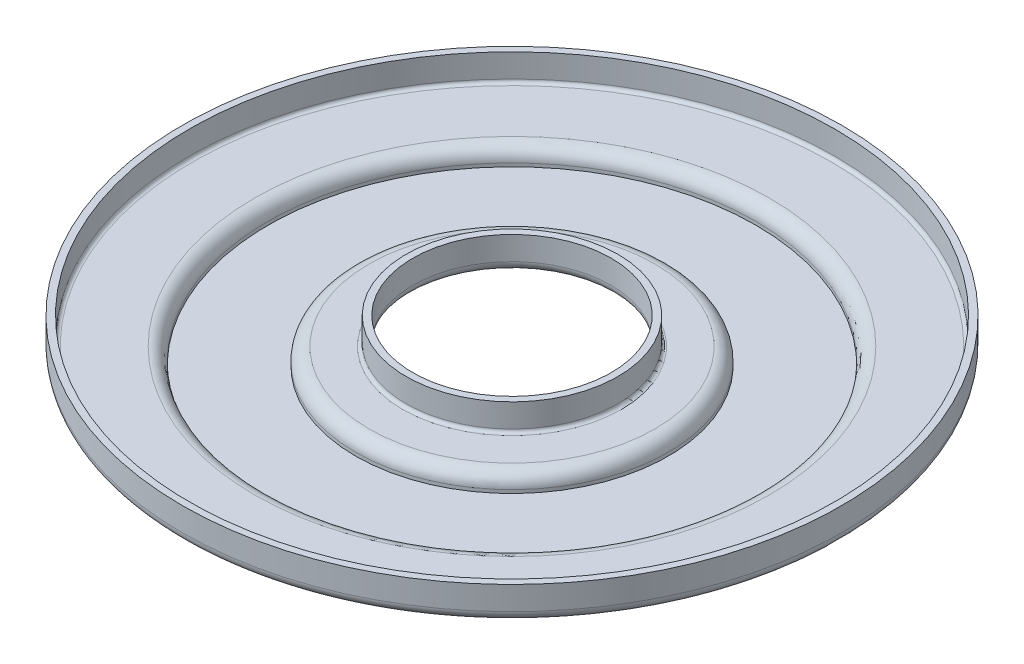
from build123d import *


with BuildPart() as part:
    # Esquisse1 → R_vol.-Mince1 (revolve)
    with BuildSketch(Plane.XY, mode=Mode.PRIVATE) as r_vol_mince1_sk:
        with BuildLine():
            Line((29.5, 15), (29.5, 8))
            ThreePointArc((29.5, 8), (30.378679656, 5.878679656), (32.5, 5))
            Line((32.5, 5), (42.5, 5))
            ThreePointArc((42.5, 5), (43.914213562, 4.414213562), (44.5, 3))
            Line((44.5, 3), (44.5, 2))
            ThreePointArc((44.5, 2), (45.085786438, 0.585786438), (46.5, 0))
            Line((46.5, 0), (72.5, 0))
            ThreePointArc((72.5, 0), (73.914213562, 0.585786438), (74.5, 2))
            Line((74.5, 2), (74.5, 3))
            ThreePointArc((74.5, 3), (75.085786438, 4.414213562), (76.5, 5))
            Line((76.5, 5), (95, 5))
            ThreePointArc((95, 5), (97.121320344, 5.878679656), (98, 8))
            Line((98, 8), (98, 15))
            Line((98, 15), (96, 15))
            Line((96, 15), (96, 8))
            ThreePointArc((96, 8), (95.707106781, 7.292893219), (95, 7))
            Line((95, 7), (76.5, 7))
            ThreePointArc((76.5, 7), (73.671572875, 5.828427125), (72.5, 3))
            Line((72.5, 3), (72.5, 2))
            Line((72.5, 2), (46.5, 2))
            Line((46.5, 2), (46.5, 3))
            ThreePointArc((46.5, 3), (45.328427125, 5.828427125), (42.5, 7))
            Line((42.5, 7), (32.5, 7))
            ThreePointArc((32.5, 7), (31.792893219, 7.292893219), (31.5, 8))
            Line((31.5, 8), (31.5, 15))
            Line((31.5, 15), (29.5, 15))
        make_face()
    revolve(r_vol_mince1_sk.sketch.rotate(Axis((0, 0, 0), (0, 1, 0)), 90), axis=Axis((0, 0, 0), (0, 1, 0)))


solid = part.part
